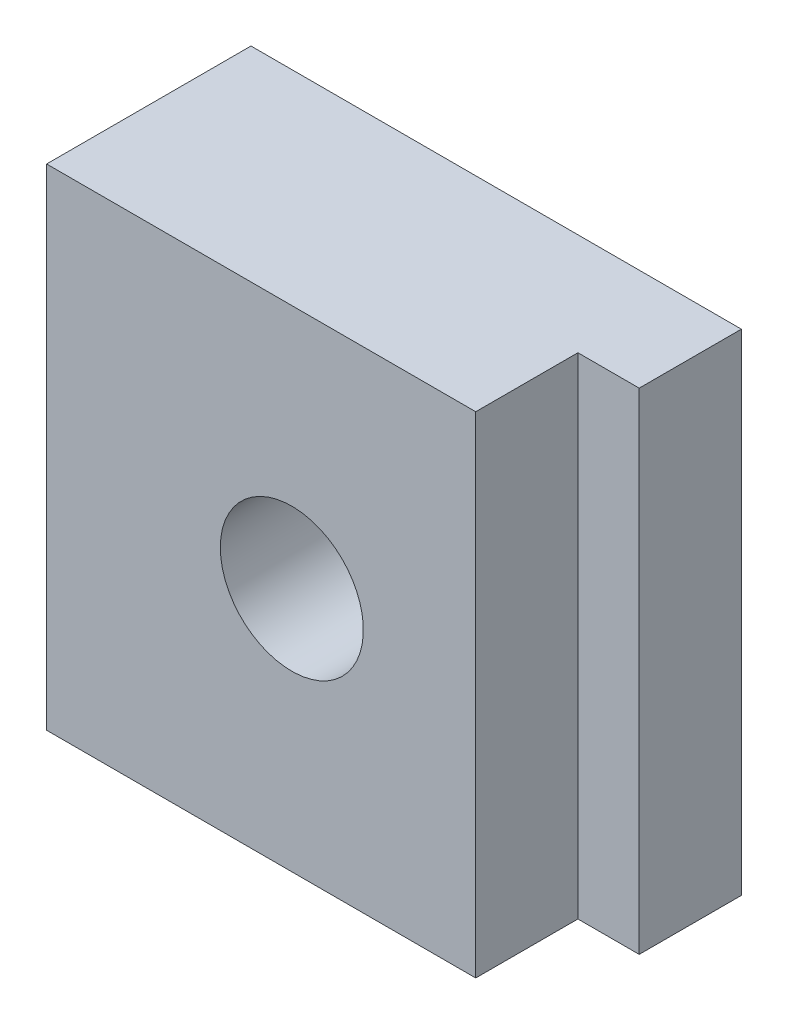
from build123d import *

# Parameters (mm, degrees)
BRIDE_DEPTH       = 6
PASSAGE_VIS_REACH = 10.846
ESQUISSE2_R       = 1.75
LAMAGE_REACH      = 10.846
ESQUISSE3_R       = 3


with BuildPart() as part:
    # Esquisse1 → Bride (new, symmetric)
    with BuildSketch(Plane(origin=(0, 0, 0), x_dir=(1, 0, 0), z_dir=(0, 1, 0))):
        Polygon((6, 2.5), (-6, 2.5), (-6, -2.5), (4.5, -2.5), (4.5, 0), (6, 0), align=None)
    extrude(amount=BRIDE_DEPTH, both=True)

    # Esquisse2 → Passage vis (cut, up to next)
    with BuildSketch(Plane.XY, mode=Mode.PRIVATE) as passage_vis_sk1:
        with Locations(Location((0, 0, 0), (0, 0, 180))):
            Circle(ESQUISSE2_R)
    passage_vis_tool1 = extrude(passage_vis_sk1.sketch, amount=PASSAGE_VIS_REACH, mode=Mode.PRIVATE) & part.part
    add(passage_vis_tool1.solids().sort_by_distance((0, 0, 0))[0], mode=Mode.SUBTRACT)

    # Esquisse3 → Lamage (cut, up to next)
    with BuildSketch(Plane.XY, mode=Mode.PRIVATE) as lamage_sk1:
        Circle(ESQUISSE3_R)
    lamage_tool1 = extrude(lamage_sk1.sketch, amount=-LAMAGE_REACH, mode=Mode.PRIVATE) & part.part
    add(lamage_tool1.solids().sort_by_distance((0, 0, 0))[0], mode=Mode.SUBTRACT)


solid = part.part
